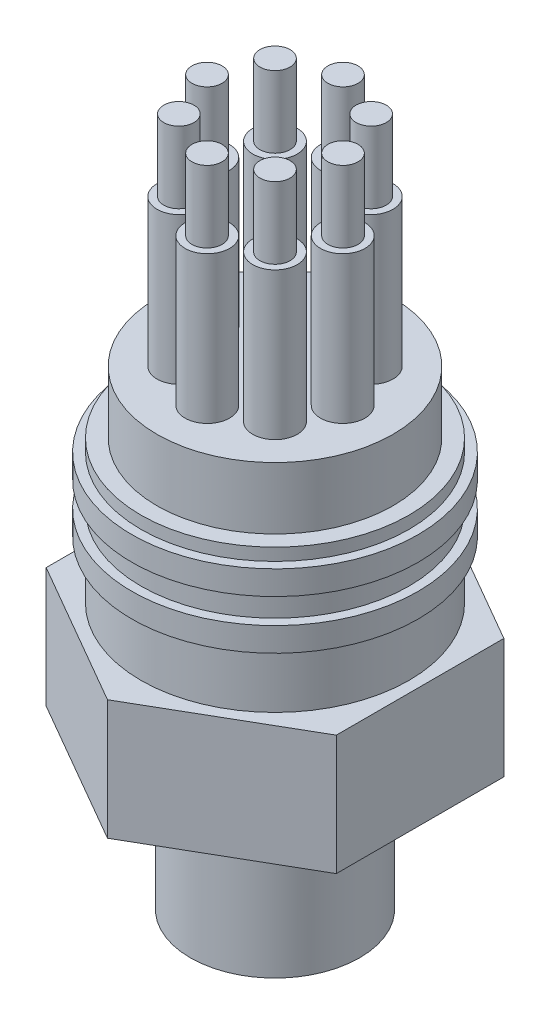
from build123d import *

# Parameters (mm, degrees)
EXTRUDE1_DEPTH     = 7.874
SKETCH3_R          = 7.747
EXTRUDE2_DEPTH     = 4.064
SKETCH4_R          = 1.4605
EXTRUDE3_DEPTH     = 9.652
SKETCH5_R          = 0.9906
EXTRUDE4_DEPTH     = 4.699
CIRPATTERN1_COUNT  = 8
SKETCH8_R          = 5.55625
EXTRUDE7_DEPTH     = 18.28030303
SKETCH9_R          = 0.89
SKETCH11_R         = 6.256635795
CUT_EXTRUDE1_DEPTH = 25.4


with BuildPart() as part:
    # Sketch1 → Extrude1 (new body)
    with BuildSketch(Plane(origin=(0, 0, 0), x_dir=(1, 0, 0), z_dir=(0, 1, 0))):
        Polygon((0, 10.998522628), (-9.525, 5.499261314), (-9.525, -5.499261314), (0, -10.998522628), (9.525, -5.499261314), (9.525, 5.499261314), align=None)
    extrude(amount=EXTRUDE1_DEPTH)

    # Sketch2 → Revolve1 (revolve)
    with BuildSketch(Plane.XY, mode=Mode.PRIVATE) as revolve1_sk:
        Polygon((8.8011, 7.874), (8.8011, 11.6586), (9.398, 11.6586), (9.398, 13.2334), (8.8011, 13.2334), (8.8011, 14.8844), (9.398, 14.8844), (9.398, 16.4592), (8.8011, 16.4592), (8.8011, 17.272), (0, 17.272), (0, 7.874), align=None)
    revolve(revolve1_sk.sketch.rotate(Axis((0, 0, 0), (0, -1, 0)), 180), axis=Axis((0, 0, 0), (0, -1, 0)))

    # Sketch3 → Extrude2 (add)
    with BuildSketch(Plane(origin=(0, 17.272, 0), x_dir=(-1, 0, 0), z_dir=(0, 1, 0))):
        with Locations(Location((0, 0, 0), (0, 0, 180))):
            Circle(SKETCH3_R)
    extrude(amount=EXTRUDE2_DEPTH)

    # Sketch4 → Extrude3 (add)
    with BuildSketch(Plane(origin=(0, 21.336, 0), x_dir=(-1, 0, 0), z_dir=(0, 1, 0))):
        with Locations((0, -4.445)):
            Circle(SKETCH4_R)
    extrude3 = extrude(amount=EXTRUDE3_DEPTH)

    # Sketch5 → Extrude4 (add)
    with BuildSketch(Plane(origin=(0, 30.988, 0), x_dir=(-1, 0, 0), z_dir=(0, 1, 0))):
        with Locations((0, -4.463933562)):
            Circle(SKETCH5_R)
    extrude4 = extrude(amount=EXTRUDE4_DEPTH)

    # CirPattern1: Extrude3, Extrude4 ×8 about axis
    cirpattern1_axis = Axis((0, 0, 0), (0, 1, 0))
    add([extrude3.rotate(cirpattern1_axis, i * 360 / CIRPATTERN1_COUNT) for i in range(1, CIRPATTERN1_COUNT)])
    add([extrude4.rotate(cirpattern1_axis, i * 360 / CIRPATTERN1_COUNT) for i in range(1, CIRPATTERN1_COUNT)])

    # Sketch8 → Extrude7 (add)
    with BuildSketch(Plane.XZ):
        with Locations(Location((0, 0, 0), (0, 0, 90))):
            Circle(SKETCH8_R)
    extrude(amount=EXTRUDE7_DEPTH)

    # Sketch9 → o-ring 12.42x1.78 (revolve)
    with BuildSketch(Plane.XY, mode=Mode.PRIVATE) as o_ring_12_42x1_78_sk:
        with Locations((7.1, 0.284318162)):
            Circle(SKETCH9_R)
    revolve(o_ring_12_42x1_78_sk.sketch.rotate(Axis((0, 0, 0), (0, -1, 0)), 90), axis=Axis((0, 0, 0), (0, -1, 0)))

    # Sketch11 → Cut-Extrude1 (cut)
    with BuildSketch(Plane.XZ.offset(9.525)):
        Circle(SKETCH11_R)
    extrude(amount=CUT_EXTRUDE1_DEPTH, mode=Mode.SUBTRACT)


solid = part.part
